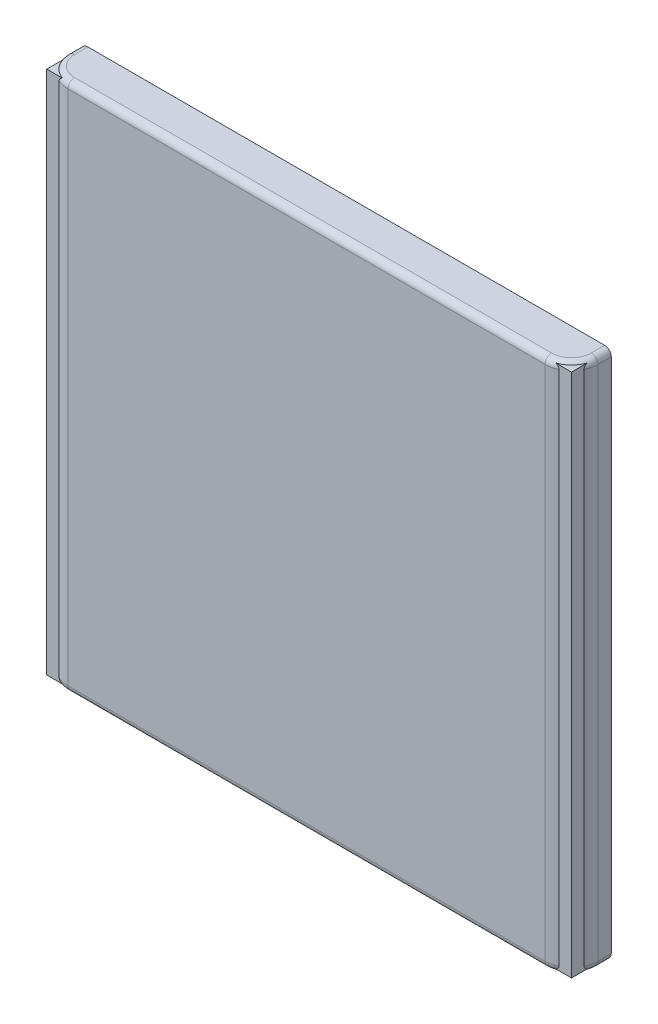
from build123d import *

# Parameters (mm, degrees)
ESQUISSE1_W        = 400
ESQUISSE1_H        = 400
BOSS_EXTRU_1_DEPTH = 30
COQUE1_T           = -2
CONG_1_R           = 20
CONG_4_R           = 5


with BuildPart() as part:
    # Esquisse1 → Boss.-Extru.1 (new body)
    with BuildSketch(Plane.XY):
        with Locations((200, 200)):
            Rectangle(ESQUISSE1_W, ESQUISSE1_H)
    extrude(amount=BOSS_EXTRU_1_DEPTH)

    # Coque1
    coque1_openings = [part.faces().sort_by_distance(p)[0] for p in [
        (200, 200, 0),
    ]]
    offset(amount=COQUE1_T, openings=coque1_openings, kind=Kind.INTERSECTION)

    # Cong_1
    cong_1_edges = [part.edges().sort_by_distance(p)[0] for p in [
        (400, 200, 30),
        (0, 200, 30),
    ]]
    fillet(cong_1_edges, radius=CONG_1_R)

    # Cong_4
    cong_4_edges = [part.edges().sort_by_distance(p)[0] for p in [
        (200, 0, 30),
        (200, 400, 30),
        (0, 400, 5),
        (400, 400, 5),
        (5.857864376, 400, 24.142135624),
        (394.142135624, 400, 24.142135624),
        (400, 0, 5),
        (0, 0, 5),
        (5.857864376, 0, 24.142135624),
        (394.142135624, 0, 24.142135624),
    ]]
    fillet(cong_4_edges, radius=CONG_4_R)


solid = part.part
